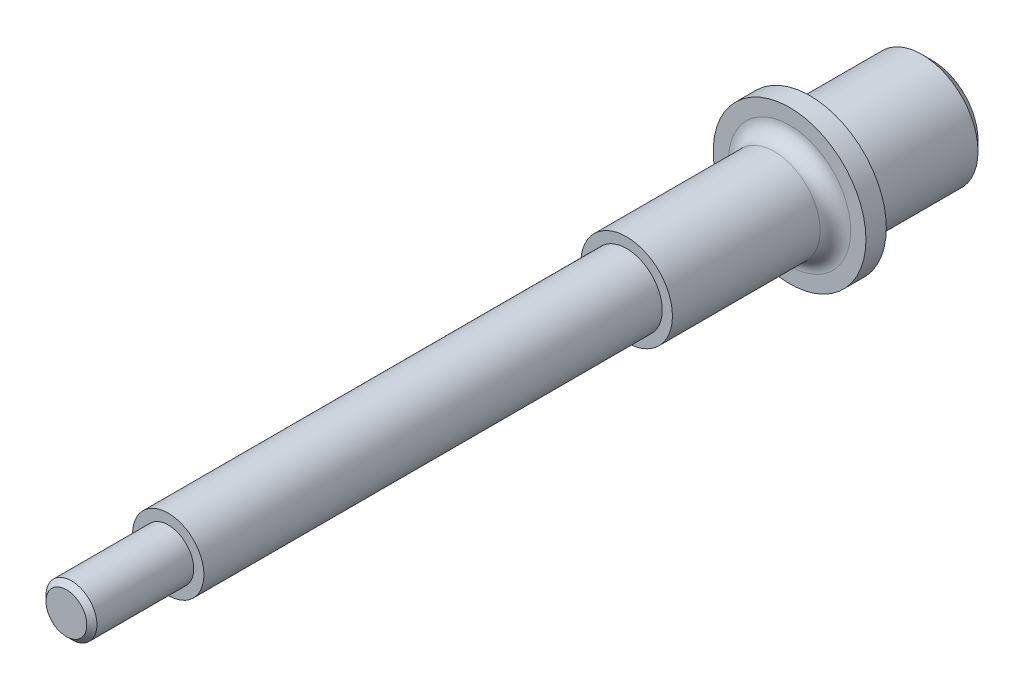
from build123d import *

# Parameters (mm, degrees)
ESBO_O1_R                = 11
RESSALTO_EXTRUS_O1_DEPTH = 24
ESBO_O2_R                = 15
RESSALTO_EXTRUS_O2_DEPTH = 4
ESBO_O3_R                = 9
RESSALTO_EXTRUS_O3_DEPTH = 32
ESBO_O4_R                = 7
RESSALTO_EXTRUS_O4_DEPTH = 90
ESBO_O5_R                = 5
RESSALTO_EXTRUS_O5_DEPTH = 20
CHANFRO1_SIZE            = 2
CHANFRO2_SIZE            = 1
FILETE2_R                = 3


with BuildPart() as part:
    # Esbo_o1 → Ressalto-extrus_o1 (new body)
    with BuildSketch(Plane.XY):
        Circle(ESBO_O1_R)
    extrude(amount=RESSALTO_EXTRUS_O1_DEPTH)

    # Esbo_o2 → Ressalto-extrus_o2 (add)
    with BuildSketch(Plane.XY.offset(24)):
        Circle(ESBO_O2_R)
    extrude(amount=RESSALTO_EXTRUS_O2_DEPTH)

    # Esbo_o3 → Ressalto-extrus_o3 (add)
    with BuildSketch(Plane.XY.offset(28)):
        Circle(ESBO_O3_R)
    extrude(amount=RESSALTO_EXTRUS_O3_DEPTH)

    # Esbo_o4 → Ressalto-extrus_o4 (add)
    with BuildSketch(Plane.XY.offset(60)):
        with Locations(Location((0, 0, 0), (0, 0, 180))):
            Circle(ESBO_O4_R)
    extrude(amount=RESSALTO_EXTRUS_O4_DEPTH)

    # Esbo_o5 → Ressalto-extrus_o5 (add)
    with BuildSketch(Plane.XY.offset(150)):
        Circle(ESBO_O5_R)
    extrude(amount=RESSALTO_EXTRUS_O5_DEPTH)

    # Chanfro1
    chanfro1_edges = [part.edges().sort_by_distance(p)[0] for p in [
        (-11, 0, 0),
    ]]
    chamfer(chanfro1_edges, length=CHANFRO1_SIZE)

    # Chanfro2
    chanfro2_edges = [part.edges().sort_by_distance(p)[0] for p in [
        (-5, 0, 170),
    ]]
    chamfer(chanfro2_edges, length=CHANFRO2_SIZE)

    # Filete2
    filete2_edges = [part.edges().sort_by_distance(p)[0] for p in [
        (-9, 0, 28),
    ]]
    fillet(filete2_edges, radius=FILETE2_R)


solid = part.part
